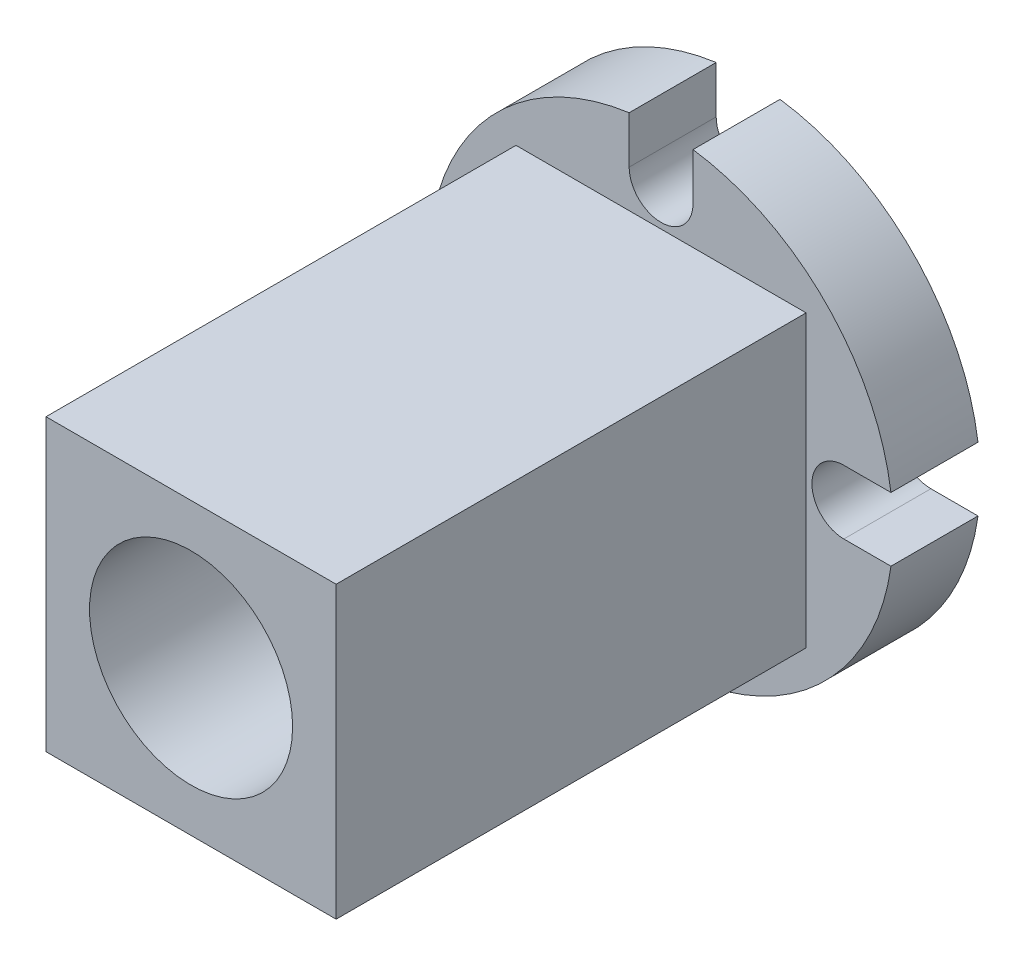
ISO-10303-21;
HEADER;
FILE_DESCRIPTION(('STEP AP214'),'2;1');
FILE_NAME('part.step','',(''),(''),'','','');
FILE_SCHEMA(('AUTOMOTIVE_DESIGN { 1 0 10303 214 1 1 1 1 }'));
ENDSEC;
DATA;
#1=APPLICATION_CONTEXT('core data for automotive mechanical design processes');
#2=APPLICATION_PROTOCOL_DEFINITION('international standard','automotive_design',2000,#1);
#3=PRODUCT_CONTEXT('',#1,'mechanical');
#4=PRODUCT('Part','Part','',(#3));
#5=PRODUCT_RELATED_PRODUCT_CATEGORY('part','',(#4));
#6=PRODUCT_DEFINITION_FORMATION('','',#4);
#7=PRODUCT_DEFINITION_CONTEXT('part definition',#1,'design');
#8=PRODUCT_DEFINITION('design','',#6,#7);
#9=PRODUCT_DEFINITION_SHAPE('','',#8);
#10=(LENGTH_UNIT() NAMED_UNIT(*) SI_UNIT(.MILLI.,.METRE.));
#11=(NAMED_UNIT(*) PLANE_ANGLE_UNIT() SI_UNIT($,.RADIAN.));
#12=(NAMED_UNIT(*) SI_UNIT($,.STERADIAN.) SOLID_ANGLE_UNIT());
#13=UNCERTAINTY_MEASURE_WITH_UNIT(LENGTH_MEASURE(1.E-05),#10,'distance_accuracy_value','');
#14=(GEOMETRIC_REPRESENTATION_CONTEXT(3) GLOBAL_UNCERTAINTY_ASSIGNED_CONTEXT((#13)) GLOBAL_UNIT_ASSIGNED_CONTEXT((#10,
#11,#12)) REPRESENTATION_CONTEXT('',''));
#15=CARTESIAN_POINT('',(0.,0.,0.));
#16=DIRECTION('',(0.,0.,1.));
#17=DIRECTION('',(1.,0.,0.));
#18=AXIS2_PLACEMENT_3D('',#15,#16,#17);
#19=CARTESIAN_POINT('',(-25.,25.,96.));
#20=DIRECTION('',(0.,0.,1.));
#21=DIRECTION('',(0.,-1.,0.));
#22=AXIS2_PLACEMENT_3D('',#19,#20,#21);
#23=PLANE('',#22);
#24=CARTESIAN_POINT('',(0.,0.,96.));
#25=DIRECTION('',(0.,0.,1.));
#26=DIRECTION('',(1.,0.,0.));
#27=AXIS2_PLACEMENT_3D('',#24,#25,#26);
#28=CIRCLE('',#27,17.5);
#29=CARTESIAN_POINT('',(17.5,0.,96.));
#30=VERTEX_POINT('',#29);
#31=EDGE_CURVE('E422',#30,#30,#28,.T.);
#32=ORIENTED_EDGE('',*,*,#31,.F.);
#33=EDGE_LOOP('',(#32));
#34=FACE_BOUND('',#33,.T.);
#35=DIRECTION('',(-1.,0.,0.));
#36=VECTOR('',#35,1.);
#37=CARTESIAN_POINT('',(25.,25.,96.));
#38=LINE('',#37,#36);
#39=CARTESIAN_POINT('',(25.,25.,96.));
#40=VERTEX_POINT('',#39);
#41=CARTESIAN_POINT('',(-25.,25.,96.));
#42=VERTEX_POINT('',#41);
#43=EDGE_CURVE('E402',#40,#42,#38,.T.);
#44=ORIENTED_EDGE('',*,*,#43,.T.);
#45=DIRECTION('',(0.,-1.,0.));
#46=VECTOR('',#45,1.);
#47=CARTESIAN_POINT('',(-25.,25.,96.));
#48=LINE('',#47,#46);
#49=CARTESIAN_POINT('',(-25.,-25.,96.));
#50=VERTEX_POINT('',#49);
#51=EDGE_CURVE('E417',#42,#50,#48,.T.);
#52=ORIENTED_EDGE('',*,*,#51,.T.);
#53=DIRECTION('',(1.,0.,0.));
#54=VECTOR('',#53,1.);
#55=CARTESIAN_POINT('',(25.,-25.,96.));
#56=LINE('',#55,#54);
#57=CARTESIAN_POINT('',(25.,-25.,96.));
#58=VERTEX_POINT('',#57);
#59=EDGE_CURVE('E414',#50,#58,#56,.T.);
#60=ORIENTED_EDGE('',*,*,#59,.T.);
#61=DIRECTION('',(0.,1.,0.));
#62=VECTOR('',#61,1.);
#63=CARTESIAN_POINT('',(25.,25.,96.));
#64=LINE('',#63,#62);
#65=EDGE_CURVE('E399',#58,#40,#64,.T.);
#66=ORIENTED_EDGE('',*,*,#65,.T.);
#67=EDGE_LOOP('',(#44,#52,#60,#66));
#68=FACE_BOUND('',#67,.T.);
#69=ADVANCED_FACE('F14',(#34,#68),#23,.T.);
#70=CARTESIAN_POINT('',(0.,0.,15.));
#71=DIRECTION('',(0.,0.,1.));
#72=DIRECTION('',(0.,-1.,0.));
#73=AXIS2_PLACEMENT_3D('',#70,#71,#72);
#74=PLANE('',#73);
#75=CARTESIAN_POINT('',(0.,0.,15.));
#76=DIRECTION('',(0.,0.,1.));
#77=DIRECTION('',(0.,-1.,0.));
#78=AXIS2_PLACEMENT_3D('',#75,#76,#77);
#79=CIRCLE('',#78,40.);
#80=CARTESIAN_POINT('',(39.6200706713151,5.5,15.));
#81=VERTEX_POINT('',#80);
#82=CARTESIAN_POINT('',(5.5,39.6200706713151,15.));
#83=VERTEX_POINT('',#82);
#84=EDGE_CURVE('E205',#81,#83,#79,.T.);
#85=ORIENTED_EDGE('',*,*,#84,.T.);
#86=DIRECTION('',(0.,-1.,0.));
#87=VECTOR('',#86,1.);
#88=CARTESIAN_POINT('',(5.5,39.6200706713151,15.));
#89=LINE('',#88,#87);
#90=CARTESIAN_POINT('',(5.5,31.5,15.));
#91=VERTEX_POINT('',#90);
#92=EDGE_CURVE('E104',#83,#91,#89,.T.);
#93=ORIENTED_EDGE('',*,*,#92,.T.);
#94=CARTESIAN_POINT('',(0.,31.5,15.));
#95=DIRECTION('',(0.,0.,-1.));
#96=DIRECTION('',(0.,-1.,0.));
#97=AXIS2_PLACEMENT_3D('',#94,#95,#96);
#98=CIRCLE('',#97,5.5);
#99=CARTESIAN_POINT('',(-5.5,31.5,15.));
#100=VERTEX_POINT('',#99);
#101=EDGE_CURVE('E360',#91,#100,#98,.T.);
#102=ORIENTED_EDGE('',*,*,#101,.T.);
#103=DIRECTION('',(0.,1.,0.));
#104=VECTOR('',#103,1.);
#105=CARTESIAN_POINT('',(-5.5,39.6200706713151,15.));
#106=LINE('',#105,#104);
#107=CARTESIAN_POINT('',(-5.5,39.6200706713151,15.));
#108=VERTEX_POINT('',#107);
#109=EDGE_CURVE('E362',#100,#108,#106,.T.);
#110=ORIENTED_EDGE('',*,*,#109,.T.);
#111=CARTESIAN_POINT('',(0.,0.,15.));
#112=DIRECTION('',(0.,0.,1.));
#113=DIRECTION('',(0.,-1.,0.));
#114=AXIS2_PLACEMENT_3D('',#111,#112,#113);
#115=CIRCLE('',#114,40.);
#116=CARTESIAN_POINT('',(-39.6200706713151,5.5,15.));
#117=VERTEX_POINT('',#116);
#118=EDGE_CURVE('E364',#108,#117,#115,.T.);
#119=ORIENTED_EDGE('',*,*,#118,.T.);
#120=DIRECTION('',(1.,0.,0.));
#121=VECTOR('',#120,1.);
#122=CARTESIAN_POINT('',(-39.6200706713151,5.5,15.));
#123=LINE('',#122,#121);
#124=CARTESIAN_POINT('',(-31.5,5.5,15.));
#125=VERTEX_POINT('',#124);
#126=EDGE_CURVE('E370',#117,#125,#123,.T.);
#127=ORIENTED_EDGE('',*,*,#126,.T.);
#128=CARTESIAN_POINT('',(-31.5,0.,15.));
#129=DIRECTION('',(0.,0.,-1.));
#130=DIRECTION('',(0.,-1.,0.));
#131=AXIS2_PLACEMENT_3D('',#128,#129,#130);
#132=CIRCLE('',#131,5.5);
#133=CARTESIAN_POINT('',(-31.5,-5.5,15.));
#134=VERTEX_POINT('',#133);
#135=EDGE_CURVE('E372',#125,#134,#132,.T.);
#136=ORIENTED_EDGE('',*,*,#135,.T.);
#137=DIRECTION('',(-1.,0.,0.));
#138=VECTOR('',#137,1.);
#139=CARTESIAN_POINT('',(-39.6200706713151,-5.5,15.));
#140=LINE('',#139,#138);
#141=CARTESIAN_POINT('',(-39.6200706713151,-5.5,15.));
#142=VERTEX_POINT('',#141);
#143=EDGE_CURVE('E374',#134,#142,#140,.T.);
#144=ORIENTED_EDGE('',*,*,#143,.T.);
#145=CARTESIAN_POINT('',(0.,0.,15.));
#146=DIRECTION('',(0.,0.,1.));
#147=DIRECTION('',(0.,-1.,0.));
#148=AXIS2_PLACEMENT_3D('',#145,#146,#147);
#149=CIRCLE('',#148,40.);
#150=CARTESIAN_POINT('',(-5.5,-39.6200706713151,15.));
#151=VERTEX_POINT('',#150);
#152=EDGE_CURVE('E376',#142,#151,#149,.T.);
#153=ORIENTED_EDGE('',*,*,#152,.T.);
#154=DIRECTION('',(0.,1.,0.));
#155=VECTOR('',#154,1.);
#156=CARTESIAN_POINT('',(-5.5,-39.6200706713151,15.));
#157=LINE('',#156,#155);
#158=CARTESIAN_POINT('',(-5.5,-31.5,15.));
#159=VERTEX_POINT('',#158);
#160=EDGE_CURVE('E378',#151,#159,#157,.T.);
#161=ORIENTED_EDGE('',*,*,#160,.T.);
#162=CARTESIAN_POINT('',(0.,-31.5,15.));
#163=DIRECTION('',(0.,0.,-1.));
#164=DIRECTION('',(0.,-1.,0.));
#165=AXIS2_PLACEMENT_3D('',#162,#163,#164);
#166=CIRCLE('',#165,5.5);
#167=CARTESIAN_POINT('',(5.5,-31.5,15.));
#168=VERTEX_POINT('',#167);
#169=EDGE_CURVE('E380',#159,#168,#166,.T.);
#170=ORIENTED_EDGE('',*,*,#169,.T.);
#171=DIRECTION('',(0.,-1.,0.));
#172=VECTOR('',#171,1.);
#173=CARTESIAN_POINT('',(5.5,-39.6200706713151,15.));
#174=LINE('',#173,#172);
#175=CARTESIAN_POINT('',(5.5,-39.6200706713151,15.));
#176=VERTEX_POINT('',#175);
#177=EDGE_CURVE('E382',#168,#176,#174,.T.);
#178=ORIENTED_EDGE('',*,*,#177,.T.);
#179=CARTESIAN_POINT('',(0.,0.,15.));
#180=DIRECTION('',(0.,0.,1.));
#181=DIRECTION('',(0.,-1.,0.));
#182=AXIS2_PLACEMENT_3D('',#179,#180,#181);
#183=CIRCLE('',#182,40.);
#184=CARTESIAN_POINT('',(39.6200706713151,-5.5,15.));
#185=VERTEX_POINT('',#184);
#186=EDGE_CURVE('E152',#176,#185,#183,.T.);
#187=ORIENTED_EDGE('',*,*,#186,.T.);
#188=DIRECTION('',(-1.,0.,0.));
#189=VECTOR('',#188,1.);
#190=CARTESIAN_POINT('',(39.6200706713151,-5.5,15.));
#191=LINE('',#190,#189);
#192=CARTESIAN_POINT('',(31.5,-5.5,15.));
#193=VERTEX_POINT('',#192);
#194=EDGE_CURVE('E144',#185,#193,#191,.T.);
#195=ORIENTED_EDGE('',*,*,#194,.T.);
#196=CARTESIAN_POINT('',(31.5,0.,15.));
#197=DIRECTION('',(0.,0.,-1.));
#198=DIRECTION('',(0.,-1.,0.));
#199=AXIS2_PLACEMENT_3D('',#196,#197,#198);
#200=CIRCLE('',#199,5.5);
#201=CARTESIAN_POINT('',(31.5,5.5,15.));
#202=VERTEX_POINT('',#201);
#203=EDGE_CURVE('E149',#193,#202,#200,.T.);
#204=ORIENTED_EDGE('',*,*,#203,.T.);
#205=DIRECTION('',(1.,0.,0.));
#206=VECTOR('',#205,1.);
#207=CARTESIAN_POINT('',(39.6200706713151,5.5,15.));
#208=LINE('',#207,#206);
#209=EDGE_CURVE('E38',#202,#81,#208,.T.);
#210=ORIENTED_EDGE('',*,*,#209,.T.);
#211=EDGE_LOOP('',(#85,#93,#102,#110,#119,#127,#136,#144,#153,#161,#170,#178,#187,#195,#204,#210));
#212=FACE_BOUND('',#211,.T.);
#213=DIRECTION('',(0.,-1.,0.));
#214=VECTOR('',#213,1.);
#215=CARTESIAN_POINT('',(-25.,25.,15.));
#216=LINE('',#215,#214);
#217=CARTESIAN_POINT('',(-25.,25.,15.));
#218=VERTEX_POINT('',#217);
#219=CARTESIAN_POINT('',(-25.,-25.,15.));
#220=VERTEX_POINT('',#219);
#221=EDGE_CURVE('E405',#218,#220,#216,.T.);
#222=ORIENTED_EDGE('',*,*,#221,.F.);
#223=DIRECTION('',(-1.,0.,0.));
#224=VECTOR('',#223,1.);
#225=CARTESIAN_POINT('',(25.,25.,15.));
#226=LINE('',#225,#224);
#227=CARTESIAN_POINT('',(25.,25.,15.));
#228=VERTEX_POINT('',#227);
#229=EDGE_CURVE('E408',#228,#218,#226,.T.);
#230=ORIENTED_EDGE('',*,*,#229,.F.);
#231=DIRECTION('',(0.,1.,0.));
#232=VECTOR('',#231,1.);
#233=CARTESIAN_POINT('',(25.,25.,15.));
#234=LINE('',#233,#232);
#235=CARTESIAN_POINT('',(25.,-25.,15.));
#236=VERTEX_POINT('',#235);
#237=EDGE_CURVE('E400',#236,#228,#234,.T.);
#238=ORIENTED_EDGE('',*,*,#237,.F.);
#239=DIRECTION('',(1.,0.,0.));
#240=VECTOR('',#239,1.);
#241=CARTESIAN_POINT('',(25.,-25.,15.));
#242=LINE('',#241,#240);
#243=EDGE_CURVE('E403',#220,#236,#242,.T.);
#244=ORIENTED_EDGE('',*,*,#243,.F.);
#245=EDGE_LOOP('',(#222,#230,#238,#244));
#246=FACE_BOUND('',#245,.T.);
#247=ADVANCED_FACE('F146',(#212,#246),#74,.T.);
#248=CARTESIAN_POINT('',(0.,0.,15.));
#249=DIRECTION('',(0.,0.,-1.));
#250=DIRECTION('',(0.,1.,0.));
#251=AXIS2_PLACEMENT_3D('',#248,#249,#250);
#252=CYLINDRICAL_SURFACE('',#251,40.);
#253=CARTESIAN_POINT('',(0.,0.,0.));
#254=DIRECTION('',(0.,0.,1.));
#255=DIRECTION('',(0.,-1.,0.));
#256=AXIS2_PLACEMENT_3D('',#253,#254,#255);
#257=CIRCLE('',#256,40.);
#258=CARTESIAN_POINT('',(39.6200706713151,5.5,0.));
#259=VERTEX_POINT('',#258);
#260=CARTESIAN_POINT('',(5.5,39.6200706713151,0.));
#261=VERTEX_POINT('',#260);
#262=EDGE_CURVE('E173',#259,#261,#257,.T.);
#263=ORIENTED_EDGE('',*,*,#262,.T.);
#264=DIRECTION('',(0.,0.,-1.));
#265=VECTOR('',#264,1.);
#266=CARTESIAN_POINT('',(5.5,39.6200706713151,15.));
#267=LINE('',#266,#265);
#268=EDGE_CURVE('E242',#83,#261,#267,.T.);
#269=ORIENTED_EDGE('',*,*,#268,.F.);
#270=ORIENTED_EDGE('',*,*,#84,.F.);
#271=DIRECTION('',(0.,0.,-1.));
#272=VECTOR('',#271,1.);
#273=CARTESIAN_POINT('',(39.6200706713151,5.5,15.));
#274=LINE('',#273,#272);
#275=EDGE_CURVE('E169',#81,#259,#274,.T.);
#276=ORIENTED_EDGE('',*,*,#275,.T.);
#277=EDGE_LOOP('',(#263,#269,#270,#276));
#278=FACE_BOUND('',#277,.T.);
#279=ADVANCED_FACE('F267',(#278),#252,.T.);
#280=CARTESIAN_POINT('',(5.5,39.6200706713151,15.));
#281=DIRECTION('',(1.,0.,0.));
#282=DIRECTION('',(0.,0.,1.));
#283=AXIS2_PLACEMENT_3D('',#280,#281,#282);
#284=PLANE('',#283);
#285=DIRECTION('',(0.,-1.,0.));
#286=VECTOR('',#285,1.);
#287=CARTESIAN_POINT('',(5.5,39.6200706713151,0.));
#288=LINE('',#287,#286);
#289=CARTESIAN_POINT('',(5.5,31.5,0.));
#290=VERTEX_POINT('',#289);
#291=EDGE_CURVE('E176',#261,#290,#288,.T.);
#292=ORIENTED_EDGE('',*,*,#291,.T.);
#293=DIRECTION('',(0.,0.,-1.));
#294=VECTOR('',#293,1.);
#295=CARTESIAN_POINT('',(5.5,31.5,15.));
#296=LINE('',#295,#294);
#297=EDGE_CURVE('E239',#91,#290,#296,.T.);
#298=ORIENTED_EDGE('',*,*,#297,.F.);
#299=ORIENTED_EDGE('',*,*,#92,.F.);
#300=ORIENTED_EDGE('',*,*,#268,.T.);
#301=EDGE_LOOP('',(#292,#298,#299,#300));
#302=FACE_BOUND('',#301,.T.);
#303=ADVANCED_FACE('F344',(#302),#284,.F.);
#304=CARTESIAN_POINT('',(0.,31.5,15.));
#305=DIRECTION('',(0.,0.,-1.));
#306=DIRECTION('',(0.,1.,0.));
#307=AXIS2_PLACEMENT_3D('',#304,#305,#306);
#308=CYLINDRICAL_SURFACE('',#307,5.5);
#309=CARTESIAN_POINT('',(0.,31.5,0.));
#310=DIRECTION('',(0.,0.,-1.));
#311=DIRECTION('',(0.,-1.,0.));
#312=AXIS2_PLACEMENT_3D('',#309,#310,#311);
#313=CIRCLE('',#312,5.5);
#314=CARTESIAN_POINT('',(-5.5,31.5,0.));
#315=VERTEX_POINT('',#314);
#316=EDGE_CURVE('E179',#290,#315,#313,.T.);
#317=ORIENTED_EDGE('',*,*,#316,.T.);
#318=DIRECTION('',(0.,0.,-1.));
#319=VECTOR('',#318,1.);
#320=CARTESIAN_POINT('',(-5.5,31.5,15.));
#321=LINE('',#320,#319);
#322=EDGE_CURVE('E236',#100,#315,#321,.T.);
#323=ORIENTED_EDGE('',*,*,#322,.F.);
#324=ORIENTED_EDGE('',*,*,#101,.F.);
#325=ORIENTED_EDGE('',*,*,#297,.T.);
#326=EDGE_LOOP('',(#317,#323,#324,#325));
#327=FACE_BOUND('',#326,.T.);
#328=ADVANCED_FACE('F340',(#327),#308,.F.);
#329=CARTESIAN_POINT('',(-5.5,39.6200706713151,15.));
#330=DIRECTION('',(-1.,0.,0.));
#331=DIRECTION('',(0.,0.,-1.));
#332=AXIS2_PLACEMENT_3D('',#329,#330,#331);
#333=PLANE('',#332);
#334=DIRECTION('',(0.,1.,0.));
#335=VECTOR('',#334,1.);
#336=CARTESIAN_POINT('',(-5.5,39.6200706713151,0.));
#337=LINE('',#336,#335);
#338=CARTESIAN_POINT('',(-5.5,39.6200706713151,0.));
#339=VERTEX_POINT('',#338);
#340=EDGE_CURVE('E181',#315,#339,#337,.T.);
#341=ORIENTED_EDGE('',*,*,#340,.T.);
#342=DIRECTION('',(0.,0.,-1.));
#343=VECTOR('',#342,1.);
#344=CARTESIAN_POINT('',(-5.5,39.6200706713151,15.));
#345=LINE('',#344,#343);
#346=EDGE_CURVE('E233',#108,#339,#345,.T.);
#347=ORIENTED_EDGE('',*,*,#346,.F.);
#348=ORIENTED_EDGE('',*,*,#109,.F.);
#349=ORIENTED_EDGE('',*,*,#322,.T.);
#350=EDGE_LOOP('',(#341,#347,#348,#349));
#351=FACE_BOUND('',#350,.T.);
#352=ADVANCED_FACE('F336',(#351),#333,.F.);
#353=CARTESIAN_POINT('',(0.,0.,15.));
#354=DIRECTION('',(0.,0.,-1.));
#355=DIRECTION('',(0.,1.,0.));
#356=AXIS2_PLACEMENT_3D('',#353,#354,#355);
#357=CYLINDRICAL_SURFACE('',#356,40.);
#358=CARTESIAN_POINT('',(0.,0.,0.));
#359=DIRECTION('',(0.,0.,1.));
#360=DIRECTION('',(0.,-1.,0.));
#361=AXIS2_PLACEMENT_3D('',#358,#359,#360);
#362=CIRCLE('',#361,40.);
#363=CARTESIAN_POINT('',(-39.6200706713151,5.5,0.));
#364=VERTEX_POINT('',#363);
#365=EDGE_CURVE('E183',#339,#364,#362,.T.);
#366=ORIENTED_EDGE('',*,*,#365,.T.);
#367=DIRECTION('',(0.,0.,-1.));
#368=VECTOR('',#367,1.);
#369=CARTESIAN_POINT('',(-39.6200706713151,5.5,15.));
#370=LINE('',#369,#368);
#371=EDGE_CURVE('E230',#117,#364,#370,.T.);
#372=ORIENTED_EDGE('',*,*,#371,.F.);
#373=ORIENTED_EDGE('',*,*,#118,.F.);
#374=ORIENTED_EDGE('',*,*,#346,.T.);
#375=EDGE_LOOP('',(#366,#372,#373,#374));
#376=FACE_BOUND('',#375,.T.);
#377=ADVANCED_FACE('F332',(#376),#357,.T.);
#378=CARTESIAN_POINT('',(-39.6200706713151,5.5,15.));
#379=DIRECTION('',(0.,1.,0.));
#380=DIRECTION('',(0.,0.,1.));
#381=AXIS2_PLACEMENT_3D('',#378,#379,#380);
#382=PLANE('',#381);
#383=DIRECTION('',(1.,0.,0.));
#384=VECTOR('',#383,1.);
#385=CARTESIAN_POINT('',(-39.6200706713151,5.5,0.));
#386=LINE('',#385,#384);
#387=CARTESIAN_POINT('',(-31.5,5.5,0.));
#388=VERTEX_POINT('',#387);
#389=EDGE_CURVE('E185',#364,#388,#386,.T.);
#390=ORIENTED_EDGE('',*,*,#389,.T.);
#391=DIRECTION('',(0.,0.,-1.));
#392=VECTOR('',#391,1.);
#393=CARTESIAN_POINT('',(-31.5,5.5,15.));
#394=LINE('',#393,#392);
#395=EDGE_CURVE('E227',#125,#388,#394,.T.);
#396=ORIENTED_EDGE('',*,*,#395,.F.);
#397=ORIENTED_EDGE('',*,*,#126,.F.);
#398=ORIENTED_EDGE('',*,*,#371,.T.);
#399=EDGE_LOOP('',(#390,#396,#397,#398));
#400=FACE_BOUND('',#399,.T.);
#401=ADVANCED_FACE('F328',(#400),#382,.F.);
#402=CARTESIAN_POINT('',(-31.5,0.,15.));
#403=DIRECTION('',(0.,0.,-1.));
#404=DIRECTION('',(0.,1.,0.));
#405=AXIS2_PLACEMENT_3D('',#402,#403,#404);
#406=CYLINDRICAL_SURFACE('',#405,5.5);
#407=CARTESIAN_POINT('',(-31.5,0.,0.));
#408=DIRECTION('',(0.,0.,-1.));
#409=DIRECTION('',(0.,-1.,0.));
#410=AXIS2_PLACEMENT_3D('',#407,#408,#409);
#411=CIRCLE('',#410,5.5);
#412=CARTESIAN_POINT('',(-31.5,-5.5,0.));
#413=VERTEX_POINT('',#412);
#414=EDGE_CURVE('E187',#388,#413,#411,.T.);
#415=ORIENTED_EDGE('',*,*,#414,.T.);
#416=DIRECTION('',(0.,0.,-1.));
#417=VECTOR('',#416,1.);
#418=CARTESIAN_POINT('',(-31.5,-5.5,15.));
#419=LINE('',#418,#417);
#420=EDGE_CURVE('E224',#134,#413,#419,.T.);
#421=ORIENTED_EDGE('',*,*,#420,.F.);
#422=ORIENTED_EDGE('',*,*,#135,.F.);
#423=ORIENTED_EDGE('',*,*,#395,.T.);
#424=EDGE_LOOP('',(#415,#421,#422,#423));
#425=FACE_BOUND('',#424,.T.);
#426=ADVANCED_FACE('F324',(#425),#406,.F.);
#427=CARTESIAN_POINT('',(-39.6200706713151,-5.5,15.));
#428=DIRECTION('',(0.,-1.,0.));
#429=DIRECTION('',(0.,0.,-1.));
#430=AXIS2_PLACEMENT_3D('',#427,#428,#429);
#431=PLANE('',#430);
#432=DIRECTION('',(-1.,0.,0.));
#433=VECTOR('',#432,1.);
#434=CARTESIAN_POINT('',(-39.6200706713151,-5.5,0.));
#435=LINE('',#434,#433);
#436=CARTESIAN_POINT('',(-39.6200706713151,-5.5,0.));
#437=VERTEX_POINT('',#436);
#438=EDGE_CURVE('E189',#413,#437,#435,.T.);
#439=ORIENTED_EDGE('',*,*,#438,.T.);
#440=DIRECTION('',(0.,0.,-1.));
#441=VECTOR('',#440,1.);
#442=CARTESIAN_POINT('',(-39.6200706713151,-5.5,15.));
#443=LINE('',#442,#441);
#444=EDGE_CURVE('E221',#142,#437,#443,.T.);
#445=ORIENTED_EDGE('',*,*,#444,.F.);
#446=ORIENTED_EDGE('',*,*,#143,.F.);
#447=ORIENTED_EDGE('',*,*,#420,.T.);
#448=EDGE_LOOP('',(#439,#445,#446,#447));
#449=FACE_BOUND('',#448,.T.);
#450=ADVANCED_FACE('F320',(#449),#431,.F.);
#451=CARTESIAN_POINT('',(0.,0.,15.));
#452=DIRECTION('',(0.,0.,-1.));
#453=DIRECTION('',(0.,1.,0.));
#454=AXIS2_PLACEMENT_3D('',#451,#452,#453);
#455=CYLINDRICAL_SURFACE('',#454,40.);
#456=CARTESIAN_POINT('',(0.,0.,0.));
#457=DIRECTION('',(0.,0.,1.));
#458=DIRECTION('',(0.,-1.,0.));
#459=AXIS2_PLACEMENT_3D('',#456,#457,#458);
#460=CIRCLE('',#459,40.);
#461=CARTESIAN_POINT('',(-5.5,-39.6200706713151,0.));
#462=VERTEX_POINT('',#461);
#463=EDGE_CURVE('E191',#437,#462,#460,.T.);
#464=ORIENTED_EDGE('',*,*,#463,.T.);
#465=DIRECTION('',(0.,0.,-1.));
#466=VECTOR('',#465,1.);
#467=CARTESIAN_POINT('',(-5.5,-39.6200706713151,15.));
#468=LINE('',#467,#466);
#469=EDGE_CURVE('E218',#151,#462,#468,.T.);
#470=ORIENTED_EDGE('',*,*,#469,.F.);
#471=ORIENTED_EDGE('',*,*,#152,.F.);
#472=ORIENTED_EDGE('',*,*,#444,.T.);
#473=EDGE_LOOP('',(#464,#470,#471,#472));
#474=FACE_BOUND('',#473,.T.);
#475=ADVANCED_FACE('F316',(#474),#455,.T.);
#476=CARTESIAN_POINT('',(-5.5,-39.6200706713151,15.));
#477=DIRECTION('',(-1.,0.,0.));
#478=DIRECTION('',(0.,0.,-1.));
#479=AXIS2_PLACEMENT_3D('',#476,#477,#478);
#480=PLANE('',#479);
#481=DIRECTION('',(0.,1.,0.));
#482=VECTOR('',#481,1.);
#483=CARTESIAN_POINT('',(-5.5,-39.6200706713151,0.));
#484=LINE('',#483,#482);
#485=CARTESIAN_POINT('',(-5.5,-31.5,0.));
#486=VERTEX_POINT('',#485);
#487=EDGE_CURVE('E193',#462,#486,#484,.T.);
#488=ORIENTED_EDGE('',*,*,#487,.T.);
#489=DIRECTION('',(0.,0.,-1.));
#490=VECTOR('',#489,1.);
#491=CARTESIAN_POINT('',(-5.5,-31.5,15.));
#492=LINE('',#491,#490);
#493=EDGE_CURVE('E215',#159,#486,#492,.T.);
#494=ORIENTED_EDGE('',*,*,#493,.F.);
#495=ORIENTED_EDGE('',*,*,#160,.F.);
#496=ORIENTED_EDGE('',*,*,#469,.T.);
#497=EDGE_LOOP('',(#488,#494,#495,#496));
#498=FACE_BOUND('',#497,.T.);
#499=ADVANCED_FACE('F312',(#498),#480,.F.);
#500=CARTESIAN_POINT('',(0.,-31.5,15.));
#501=DIRECTION('',(0.,0.,-1.));
#502=DIRECTION('',(0.,1.,0.));
#503=AXIS2_PLACEMENT_3D('',#500,#501,#502);
#504=CYLINDRICAL_SURFACE('',#503,5.5);
#505=CARTESIAN_POINT('',(0.,-31.5,0.));
#506=DIRECTION('',(0.,0.,-1.));
#507=DIRECTION('',(0.,-1.,0.));
#508=AXIS2_PLACEMENT_3D('',#505,#506,#507);
#509=CIRCLE('',#508,5.5);
#510=CARTESIAN_POINT('',(5.5,-31.5,0.));
#511=VERTEX_POINT('',#510);
#512=EDGE_CURVE('E195',#486,#511,#509,.T.);
#513=ORIENTED_EDGE('',*,*,#512,.T.);
#514=DIRECTION('',(0.,0.,-1.));
#515=VECTOR('',#514,1.);
#516=CARTESIAN_POINT('',(5.5,-31.5,15.));
#517=LINE('',#516,#515);
#518=EDGE_CURVE('E212',#168,#511,#517,.T.);
#519=ORIENTED_EDGE('',*,*,#518,.F.);
#520=ORIENTED_EDGE('',*,*,#169,.F.);
#521=ORIENTED_EDGE('',*,*,#493,.T.);
#522=EDGE_LOOP('',(#513,#519,#520,#521));
#523=FACE_BOUND('',#522,.T.);
#524=ADVANCED_FACE('F308',(#523),#504,.F.);
#525=CARTESIAN_POINT('',(5.5,-39.6200706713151,15.));
#526=DIRECTION('',(1.,0.,0.));
#527=DIRECTION('',(0.,0.,1.));
#528=AXIS2_PLACEMENT_3D('',#525,#526,#527);
#529=PLANE('',#528);
#530=DIRECTION('',(0.,-1.,0.));
#531=VECTOR('',#530,1.);
#532=CARTESIAN_POINT('',(5.5,-39.6200706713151,0.));
#533=LINE('',#532,#531);
#534=CARTESIAN_POINT('',(5.5,-39.6200706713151,0.));
#535=VERTEX_POINT('',#534);
#536=EDGE_CURVE('E197',#511,#535,#533,.T.);
#537=ORIENTED_EDGE('',*,*,#536,.T.);
#538=DIRECTION('',(0.,0.,-1.));
#539=VECTOR('',#538,1.);
#540=CARTESIAN_POINT('',(5.5,-39.6200706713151,15.));
#541=LINE('',#540,#539);
#542=EDGE_CURVE('E209',#176,#535,#541,.T.);
#543=ORIENTED_EDGE('',*,*,#542,.F.);
#544=ORIENTED_EDGE('',*,*,#177,.F.);
#545=ORIENTED_EDGE('',*,*,#518,.T.);
#546=EDGE_LOOP('',(#537,#543,#544,#545));
#547=FACE_BOUND('',#546,.T.);
#548=ADVANCED_FACE('F304',(#547),#529,.F.);
#549=CARTESIAN_POINT('',(0.,0.,15.));
#550=DIRECTION('',(0.,0.,-1.));
#551=DIRECTION('',(0.,1.,0.));
#552=AXIS2_PLACEMENT_3D('',#549,#550,#551);
#553=CYLINDRICAL_SURFACE('',#552,40.);
#554=CARTESIAN_POINT('',(0.,0.,0.));
#555=DIRECTION('',(0.,0.,1.));
#556=DIRECTION('',(0.,-1.,0.));
#557=AXIS2_PLACEMENT_3D('',#554,#555,#556);
#558=CIRCLE('',#557,40.);
#559=CARTESIAN_POINT('',(39.6200706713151,-5.5,0.));
#560=VERTEX_POINT('',#559);
#561=EDGE_CURVE('E199',#535,#560,#558,.T.);
#562=ORIENTED_EDGE('',*,*,#561,.T.);
#563=DIRECTION('',(0.,0.,-1.));
#564=VECTOR('',#563,1.);
#565=CARTESIAN_POINT('',(39.6200706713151,-5.5,15.));
#566=LINE('',#565,#564);
#567=EDGE_CURVE('E164',#185,#560,#566,.T.);
#568=ORIENTED_EDGE('',*,*,#567,.F.);
#569=ORIENTED_EDGE('',*,*,#186,.F.);
#570=ORIENTED_EDGE('',*,*,#542,.T.);
#571=EDGE_LOOP('',(#562,#568,#569,#570));
#572=FACE_BOUND('',#571,.T.);
#573=ADVANCED_FACE('F301',(#572),#553,.T.);
#574=CARTESIAN_POINT('',(39.6200706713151,-5.5,15.));
#575=DIRECTION('',(0.,-1.,0.));
#576=DIRECTION('',(0.,0.,-1.));
#577=AXIS2_PLACEMENT_3D('',#574,#575,#576);
#578=PLANE('',#577);
#579=DIRECTION('',(-1.,0.,0.));
#580=VECTOR('',#579,1.);
#581=CARTESIAN_POINT('',(39.6200706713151,-5.5,0.));
#582=LINE('',#581,#580);
#583=CARTESIAN_POINT('',(31.5,-5.5,0.));
#584=VERTEX_POINT('',#583);
#585=EDGE_CURVE('E161',#560,#584,#582,.T.);
#586=ORIENTED_EDGE('',*,*,#585,.T.);
#587=DIRECTION('',(0.,0.,-1.));
#588=VECTOR('',#587,1.);
#589=CARTESIAN_POINT('',(31.5,-5.5,15.));
#590=LINE('',#589,#588);
#591=EDGE_CURVE('E158',#193,#584,#590,.T.);
#592=ORIENTED_EDGE('',*,*,#591,.F.);
#593=ORIENTED_EDGE('',*,*,#194,.F.);
#594=ORIENTED_EDGE('',*,*,#567,.T.);
#595=EDGE_LOOP('',(#586,#592,#593,#594));
#596=FACE_BOUND('',#595,.T.);
#597=ADVANCED_FACE('F159',(#596),#578,.F.);
#598=CARTESIAN_POINT('',(31.5,0.,15.));
#599=DIRECTION('',(0.,0.,-1.));
#600=DIRECTION('',(0.,1.,0.));
#601=AXIS2_PLACEMENT_3D('',#598,#599,#600);
#602=CYLINDRICAL_SURFACE('',#601,5.5);
#603=CARTESIAN_POINT('',(31.5,0.,0.));
#604=DIRECTION('',(0.,0.,-1.));
#605=DIRECTION('',(0.,-1.,0.));
#606=AXIS2_PLACEMENT_3D('',#603,#604,#605);
#607=CIRCLE('',#606,5.5);
#608=CARTESIAN_POINT('',(31.5,5.5,0.));
#609=VERTEX_POINT('',#608);
#610=EDGE_CURVE('E202',#584,#609,#607,.T.);
#611=ORIENTED_EDGE('',*,*,#610,.T.);
#612=DIRECTION('',(0.,0.,-1.));
#613=VECTOR('',#612,1.);
#614=CARTESIAN_POINT('',(31.5,5.5,15.));
#615=LINE('',#614,#613);
#616=EDGE_CURVE('E165',#202,#609,#615,.T.);
#617=ORIENTED_EDGE('',*,*,#616,.F.);
#618=ORIENTED_EDGE('',*,*,#203,.F.);
#619=ORIENTED_EDGE('',*,*,#591,.T.);
#620=EDGE_LOOP('',(#611,#617,#618,#619));
#621=FACE_BOUND('',#620,.T.);
#622=ADVANCED_FACE('F167',(#621),#602,.F.);
#623=CARTESIAN_POINT('',(39.6200706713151,5.5,15.));
#624=DIRECTION('',(0.,1.,0.));
#625=DIRECTION('',(0.,0.,1.));
#626=AXIS2_PLACEMENT_3D('',#623,#624,#625);
#627=PLANE('',#626);
#628=DIRECTION('',(1.,0.,0.));
#629=VECTOR('',#628,1.);
#630=CARTESIAN_POINT('',(39.6200706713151,5.5,0.));
#631=LINE('',#630,#629);
#632=EDGE_CURVE('E95',#609,#259,#631,.T.);
#633=ORIENTED_EDGE('',*,*,#632,.T.);
#634=ORIENTED_EDGE('',*,*,#275,.F.);
#635=ORIENTED_EDGE('',*,*,#209,.F.);
#636=ORIENTED_EDGE('',*,*,#616,.T.);
#637=EDGE_LOOP('',(#633,#634,#635,#636));
#638=FACE_BOUND('',#637,.T.);
#639=ADVANCED_FACE('F293',(#638),#627,.F.);
#640=CARTESIAN_POINT('',(0.,0.,0.));
#641=DIRECTION('',(0.,0.,1.));
#642=DIRECTION('',(0.,-1.,0.));
#643=AXIS2_PLACEMENT_3D('',#640,#641,#642);
#644=PLANE('',#643);
#645=CARTESIAN_POINT('',(0.,0.,0.));
#646=DIRECTION('',(0.,0.,1.));
#647=DIRECTION('',(1.,0.,0.));
#648=AXIS2_PLACEMENT_3D('',#645,#646,#647);
#649=CIRCLE('',#648,7.);
#650=CARTESIAN_POINT('',(7.,0.,0.));
#651=VERTEX_POINT('',#650);
#652=EDGE_CURVE('E9',#651,#651,#649,.T.);
#653=ORIENTED_EDGE('',*,*,#652,.T.);
#654=EDGE_LOOP('',(#653));
#655=FACE_BOUND('',#654,.T.);
#656=ORIENTED_EDGE('',*,*,#262,.F.);
#657=ORIENTED_EDGE('',*,*,#632,.F.);
#658=ORIENTED_EDGE('',*,*,#610,.F.);
#659=ORIENTED_EDGE('',*,*,#585,.F.);
#660=ORIENTED_EDGE('',*,*,#561,.F.);
#661=ORIENTED_EDGE('',*,*,#536,.F.);
#662=ORIENTED_EDGE('',*,*,#512,.F.);
#663=ORIENTED_EDGE('',*,*,#487,.F.);
#664=ORIENTED_EDGE('',*,*,#463,.F.);
#665=ORIENTED_EDGE('',*,*,#438,.F.);
#666=ORIENTED_EDGE('',*,*,#414,.F.);
#667=ORIENTED_EDGE('',*,*,#389,.F.);
#668=ORIENTED_EDGE('',*,*,#365,.F.);
#669=ORIENTED_EDGE('',*,*,#340,.F.);
#670=ORIENTED_EDGE('',*,*,#316,.F.);
#671=ORIENTED_EDGE('',*,*,#291,.F.);
#672=EDGE_LOOP('',(#656,#657,#658,#659,#660,#661,#662,#663,#664,#665,#666,#667,#668,#669,#670,#671));
#673=FACE_BOUND('',#672,.T.);
#674=ADVANCED_FACE('F288',(#655,#673),#644,.F.);
#675=CARTESIAN_POINT('',(25.,25.,96.));
#676=DIRECTION('',(0.,-1.,0.));
#677=DIRECTION('',(1.,0.,0.));
#678=AXIS2_PLACEMENT_3D('',#675,#676,#677);
#679=PLANE('',#678);
#680=ORIENTED_EDGE('',*,*,#229,.T.);
#681=DIRECTION('',(0.,0.,-1.));
#682=VECTOR('',#681,1.);
#683=CARTESIAN_POINT('',(-25.,25.,96.));
#684=LINE('',#683,#682);
#685=EDGE_CURVE('E177',#42,#218,#684,.T.);
#686=ORIENTED_EDGE('',*,*,#685,.F.);
#687=ORIENTED_EDGE('',*,*,#43,.F.);
#688=DIRECTION('',(0.,0.,-1.));
#689=VECTOR('',#688,1.);
#690=CARTESIAN_POINT('',(25.,25.,96.));
#691=LINE('',#690,#689);
#692=EDGE_CURVE('E396',#40,#228,#691,.T.);
#693=ORIENTED_EDGE('',*,*,#692,.T.);
#694=EDGE_LOOP('',(#680,#686,#687,#693));
#695=FACE_BOUND('',#694,.T.);
#696=ADVANCED_FACE('F285',(#695),#679,.F.);
#697=CARTESIAN_POINT('',(-25.,25.,96.));
#698=DIRECTION('',(1.,0.,0.));
#699=DIRECTION('',(0.,0.,1.));
#700=AXIS2_PLACEMENT_3D('',#697,#698,#699);
#701=PLANE('',#700);
#702=ORIENTED_EDGE('',*,*,#221,.T.);
#703=DIRECTION('',(0.,0.,-1.));
#704=VECTOR('',#703,1.);
#705=CARTESIAN_POINT('',(-25.,-25.,96.));
#706=LINE('',#705,#704);
#707=EDGE_CURVE('E392',#50,#220,#706,.T.);
#708=ORIENTED_EDGE('',*,*,#707,.F.);
#709=ORIENTED_EDGE('',*,*,#51,.F.);
#710=ORIENTED_EDGE('',*,*,#685,.T.);
#711=EDGE_LOOP('',(#702,#708,#709,#710));
#712=FACE_BOUND('',#711,.T.);
#713=ADVANCED_FACE('F281',(#712),#701,.F.);
#714=CARTESIAN_POINT('',(25.,-25.,96.));
#715=DIRECTION('',(0.,1.,0.));
#716=DIRECTION('',(-1.,0.,0.));
#717=AXIS2_PLACEMENT_3D('',#714,#715,#716);
#718=PLANE('',#717);
#719=ORIENTED_EDGE('',*,*,#243,.T.);
#720=DIRECTION('',(0.,0.,-1.));
#721=VECTOR('',#720,1.);
#722=CARTESIAN_POINT('',(25.,-25.,96.));
#723=LINE('',#722,#721);
#724=EDGE_CURVE('E29',#58,#236,#723,.T.);
#725=ORIENTED_EDGE('',*,*,#724,.F.);
#726=ORIENTED_EDGE('',*,*,#59,.F.);
#727=ORIENTED_EDGE('',*,*,#707,.T.);
#728=EDGE_LOOP('',(#719,#725,#726,#727));
#729=FACE_BOUND('',#728,.T.);
#730=ADVANCED_FACE('F278',(#729),#718,.F.);
#731=CARTESIAN_POINT('',(25.,25.,96.));
#732=DIRECTION('',(-1.,0.,0.));
#733=DIRECTION('',(0.,0.,-1.));
#734=AXIS2_PLACEMENT_3D('',#731,#732,#733);
#735=PLANE('',#734);
#736=ORIENTED_EDGE('',*,*,#237,.T.);
#737=ORIENTED_EDGE('',*,*,#692,.F.);
#738=ORIENTED_EDGE('',*,*,#65,.F.);
#739=ORIENTED_EDGE('',*,*,#724,.T.);
#740=EDGE_LOOP('',(#736,#737,#738,#739));
#741=FACE_BOUND('',#740,.T.);
#742=ADVANCED_FACE('F275',(#741),#735,.F.);
#743=CARTESIAN_POINT('',(0.,0.,66.));
#744=DIRECTION('',(0.,0.,1.));
#745=DIRECTION('',(1.,0.,0.));
#746=AXIS2_PLACEMENT_3D('',#743,#744,#745);
#747=CYLINDRICAL_SURFACE('',#746,17.5);
#748=CARTESIAN_POINT('',(0.,0.,66.));
#749=DIRECTION('',(0.,0.,1.));
#750=DIRECTION('',(1.,0.,0.));
#751=AXIS2_PLACEMENT_3D('',#748,#749,#750);
#752=CIRCLE('',#751,17.5);
#753=CARTESIAN_POINT('',(17.5,0.,66.));
#754=VERTEX_POINT('',#753);
#755=EDGE_CURVE('E411',#754,#754,#752,.T.);
#756=ORIENTED_EDGE('',*,*,#755,.F.);
#757=EDGE_LOOP('',(#756));
#758=FACE_BOUND('',#757,.T.);
#759=ORIENTED_EDGE('',*,*,#31,.T.);
#760=EDGE_LOOP('',(#759));
#761=FACE_BOUND('',#760,.T.);
#762=ADVANCED_FACE('F273',(#758,#761),#747,.F.);
#763=CARTESIAN_POINT('',(0.,0.,66.));
#764=DIRECTION('',(0.,0.,1.));
#765=DIRECTION('',(1.,0.,0.));
#766=AXIS2_PLACEMENT_3D('',#763,#764,#765);
#767=PLANE('',#766);
#768=ORIENTED_EDGE('',*,*,#755,.T.);
#769=EDGE_LOOP('',(#768));
#770=FACE_BOUND('',#769,.T.);
#771=ADVANCED_FACE('F431',(#770),#767,.T.);
#772=CARTESIAN_POINT('',(0.,0.,40.));
#773=DIRECTION('',(0.,0.,-1.));
#774=DIRECTION('',(-1.,0.,0.));
#775=AXIS2_PLACEMENT_3D('',#772,#773,#774);
#776=CYLINDRICAL_SURFACE('',#775,6.);
#777=CARTESIAN_POINT('',(0.,0.,1.00000000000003));
#778=DIRECTION('',(0.,0.,1.));
#779=DIRECTION('',(1.,0.,0.));
#780=AXIS2_PLACEMENT_3D('',#777,#778,#779);
#781=CIRCLE('',#780,6.);
#782=CARTESIAN_POINT('',(6.,0.,1.00000000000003));
#783=VERTEX_POINT('',#782);
#784=EDGE_CURVE('E22',#783,#783,#781,.F.);
#785=ORIENTED_EDGE('',*,*,#784,.T.);
#786=EDGE_LOOP('',(#785));
#787=FACE_BOUND('',#786,.T.);
#788=CARTESIAN_POINT('',(0.,0.,40.));
#789=DIRECTION('',(0.,0.,-1.));
#790=DIRECTION('',(-1.,0.,0.));
#791=AXIS2_PLACEMENT_3D('',#788,#789,#790);
#792=CIRCLE('',#791,6.);
#793=CARTESIAN_POINT('',(-6.,0.,40.));
#794=VERTEX_POINT('',#793);
#795=EDGE_CURVE('E425',#794,#794,#792,.T.);
#796=ORIENTED_EDGE('',*,*,#795,.F.);
#797=EDGE_LOOP('',(#796));
#798=FACE_BOUND('',#797,.T.);
#799=ADVANCED_FACE('F246',(#787,#798),#776,.F.);
#800=CARTESIAN_POINT('',(0.,0.,40.));
#801=DIRECTION('',(0.,0.,-1.));
#802=DIRECTION('',(-1.,0.,0.));
#803=AXIS2_PLACEMENT_3D('',#800,#801,#802);
#804=PLANE('',#803);
#805=ORIENTED_EDGE('',*,*,#795,.T.);
#806=EDGE_LOOP('',(#805));
#807=FACE_BOUND('',#806,.T.);
#808=ADVANCED_FACE('F250',(#807),#804,.T.);
#809=CARTESIAN_POINT('',(0.,0.,1.00000000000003));
#810=DIRECTION('',(0.,0.,-1.));
#811=DIRECTION('',(-1.,0.,0.));
#812=AXIS2_PLACEMENT_3D('',#809,#810,#811);
#813=CONICAL_SURFACE('',#812,6.,0.78539816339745);
#814=ORIENTED_EDGE('',*,*,#652,.F.);
#815=EDGE_LOOP('',(#814));
#816=FACE_BOUND('',#815,.T.);
#817=ORIENTED_EDGE('',*,*,#784,.F.);
#818=EDGE_LOOP('',(#817));
#819=FACE_BOUND('',#818,.T.);
#820=ADVANCED_FACE('F16',(#816,#819),#813,.F.);
#821=CLOSED_SHELL('',(#69,#247,#279,#303,#328,#352,#377,#401,#426,#450,#475,#499,#524,#548,#573,
#597,#622,#639,#674,#696,#713,#730,#742,#762,#771,#799,#808,#820));
#822=MANIFOLD_SOLID_BREP('B1',#821);
#823=ADVANCED_BREP_SHAPE_REPRESENTATION('',(#18,#822),#14);
#824=SHAPE_DEFINITION_REPRESENTATION(#9,#823);
ENDSEC;
END-ISO-10303-21;
